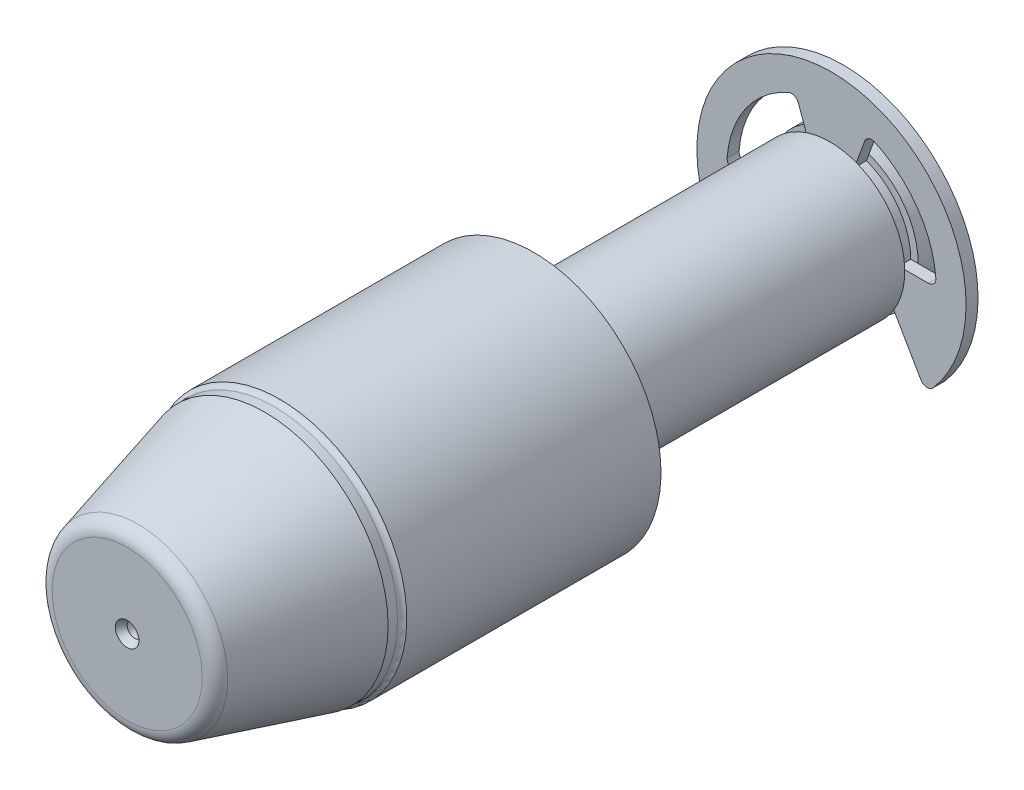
ISO-10303-21;
HEADER;
FILE_DESCRIPTION(('STEP AP214'),'2;1');
FILE_NAME('part.step','',(''),(''),'','','');
FILE_SCHEMA(('AUTOMOTIVE_DESIGN { 1 0 10303 214 1 1 1 1 }'));
ENDSEC;
DATA;
#1=APPLICATION_CONTEXT('core data for automotive mechanical design processes');
#2=APPLICATION_PROTOCOL_DEFINITION('international standard','automotive_design',2000,#1);
#3=PRODUCT_CONTEXT('',#1,'mechanical');
#4=PRODUCT('Part','Part','',(#3));
#5=PRODUCT_RELATED_PRODUCT_CATEGORY('part','',(#4));
#6=PRODUCT_DEFINITION_FORMATION('','',#4);
#7=PRODUCT_DEFINITION_CONTEXT('part definition',#1,'design');
#8=PRODUCT_DEFINITION('design','',#6,#7);
#9=PRODUCT_DEFINITION_SHAPE('','',#8);
#10=(LENGTH_UNIT() NAMED_UNIT(*) SI_UNIT(.MILLI.,.METRE.));
#11=(NAMED_UNIT(*) PLANE_ANGLE_UNIT() SI_UNIT($,.RADIAN.));
#12=(NAMED_UNIT(*) SI_UNIT($,.STERADIAN.) SOLID_ANGLE_UNIT());
#13=UNCERTAINTY_MEASURE_WITH_UNIT(LENGTH_MEASURE(1.E-05),#10,'distance_accuracy_value','');
#14=(GEOMETRIC_REPRESENTATION_CONTEXT(3) GLOBAL_UNCERTAINTY_ASSIGNED_CONTEXT((#13)) GLOBAL_UNIT_ASSIGNED_CONTEXT((#10,
#11,#12)) REPRESENTATION_CONTEXT('',''));
#15=CARTESIAN_POINT('',(0.,0.,0.));
#16=DIRECTION('',(0.,0.,1.));
#17=DIRECTION('',(1.,0.,0.));
#18=AXIS2_PLACEMENT_3D('',#15,#16,#17);
#19=CARTESIAN_POINT('',(0.,0.,26.2));
#20=DIRECTION('',(0.,0.,-1.));
#21=DIRECTION('',(0.,-1.,0.));
#22=AXIS2_PLACEMENT_3D('',#19,#20,#21);
#23=TOROIDAL_SURFACE('',#22,5.01754044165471,1.);
#24=CARTESIAN_POINT('',(0.,0.,26.4588190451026));
#25=DIRECTION('',(0.,0.,-1.));
#26=DIRECTION('',(0.,-1.,0.));
#27=AXIS2_PLACEMENT_3D('',#24,#25,#26);
#28=CIRCLE('',#27,5.98346626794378);
#29=CARTESIAN_POINT('',(0.,-5.98346626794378,26.4588190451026));
#30=VERTEX_POINT('',#29);
#31=EDGE_CURVE('E186',#30,#30,#28,.T.);
#32=ORIENTED_EDGE('',*,*,#31,.F.);
#33=EDGE_LOOP('',(#32));
#34=FACE_BOUND('',#33,.T.);
#35=CARTESIAN_POINT('',(0.,0.,27.2));
#36=DIRECTION('',(0.,0.,-1.));
#37=DIRECTION('',(0.,-1.,0.));
#38=AXIS2_PLACEMENT_3D('',#35,#36,#37);
#39=CIRCLE('',#38,5.01754044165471);
#40=CARTESIAN_POINT('',(0.,-5.01754044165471,27.2));
#41=VERTEX_POINT('',#40);
#42=EDGE_CURVE('E190',#41,#41,#39,.T.);
#43=ORIENTED_EDGE('',*,*,#42,.T.);
#44=EDGE_LOOP('',(#43));
#45=FACE_BOUND('',#44,.T.);
#46=ADVANCED_FACE('F14',(#34,#45),#23,.T.);
#47=CARTESIAN_POINT('',(0.,5.01754044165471,27.2));
#48=DIRECTION('',(0.,0.,-1.));
#49=DIRECTION('',(0.,-1.,0.));
#50=AXIS2_PLACEMENT_3D('',#47,#48,#49);
#51=PLANE('',#50);
#52=CARTESIAN_POINT('',(0.,0.,27.2));
#53=DIRECTION('',(0.,0.,-1.));
#54=DIRECTION('',(0.,-1.,0.));
#55=AXIS2_PLACEMENT_3D('',#52,#53,#54);
#56=CIRCLE('',#55,0.788675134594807);
#57=CARTESIAN_POINT('',(0.,-0.788675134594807,27.2));
#58=VERTEX_POINT('',#57);
#59=EDGE_CURVE('E201',#58,#58,#56,.T.);
#60=ORIENTED_EDGE('',*,*,#59,.T.);
#61=EDGE_LOOP('',(#60));
#62=FACE_BOUND('',#61,.T.);
#63=ORIENTED_EDGE('',*,*,#42,.F.);
#64=EDGE_LOOP('',(#63));
#65=FACE_BOUND('',#64,.T.);
#66=ADVANCED_FACE('F406',(#62,#65),#51,.F.);
#67=CARTESIAN_POINT('',(0.,0.,26.4588190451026));
#68=DIRECTION('',(0.,0.,-1.));
#69=DIRECTION('',(0.,-1.,0.));
#70=AXIS2_PLACEMENT_3D('',#67,#68,#69);
#71=CONICAL_SURFACE('',#70,5.98346626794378,0.26179938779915);
#72=CARTESIAN_POINT('',(0.,0.,18.));
#73=DIRECTION('',(0.,0.,-1.));
#74=DIRECTION('',(0.,-1.,0.));
#75=AXIS2_PLACEMENT_3D('',#72,#73,#74);
#76=CIRCLE('',#75,8.25);
#77=CARTESIAN_POINT('',(0.,-8.25,18.));
#78=VERTEX_POINT('',#77);
#79=EDGE_CURVE('E396',#78,#78,#76,.T.);
#80=ORIENTED_EDGE('',*,*,#79,.F.);
#81=EDGE_LOOP('',(#80));
#82=FACE_BOUND('',#81,.T.);
#83=ORIENTED_EDGE('',*,*,#31,.T.);
#84=EDGE_LOOP('',(#83));
#85=FACE_BOUND('',#84,.T.);
#86=ADVANCED_FACE('F402',(#82,#85),#71,.T.);
#87=CARTESIAN_POINT('',(0.,0.,26.7));
#88=DIRECTION('',(0.,0.,1.));
#89=DIRECTION('',(0.,1.,0.));
#90=AXIS2_PLACEMENT_3D('',#87,#88,#89);
#91=CONICAL_SURFACE('',#90,0.5,0.523598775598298);
#92=ORIENTED_EDGE('',*,*,#59,.F.);
#93=EDGE_LOOP('',(#92));
#94=FACE_BOUND('',#93,.T.);
#95=CARTESIAN_POINT('',(0.,0.,26.7));
#96=DIRECTION('',(0.,0.,-1.));
#97=DIRECTION('',(0.,-1.,0.));
#98=AXIS2_PLACEMENT_3D('',#95,#96,#97);
#99=CIRCLE('',#98,0.5);
#100=CARTESIAN_POINT('',(0.,-0.5,26.7));
#101=VERTEX_POINT('',#100);
#102=EDGE_CURVE('E198',#101,#101,#99,.F.);
#103=ORIENTED_EDGE('',*,*,#102,.F.);
#104=EDGE_LOOP('',(#103));
#105=FACE_BOUND('',#104,.T.);
#106=ADVANCED_FACE('F419',(#94,#105),#91,.F.);
#107=CARTESIAN_POINT('',(0.,0.,-23.6077483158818));
#108=DIRECTION('',(0.,0.,-1.));
#109=DIRECTION('',(0.,-1.,0.));
#110=AXIS2_PLACEMENT_3D('',#107,#108,#109);
#111=CYLINDRICAL_SURFACE('',#110,8.25);
#112=CARTESIAN_POINT('',(0.,0.,17.3708099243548));
#113=DIRECTION('',(0.,0.,-1.));
#114=DIRECTION('',(0.,-1.,0.));
#115=AXIS2_PLACEMENT_3D('',#112,#113,#114);
#116=CIRCLE('',#115,8.25);
#117=CARTESIAN_POINT('',(0.,-8.25,17.3708099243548));
#118=VERTEX_POINT('',#117);
#119=EDGE_CURVE('E210',#118,#118,#116,.F.);
#120=ORIENTED_EDGE('',*,*,#119,.T.);
#121=EDGE_LOOP('',(#120));
#122=FACE_BOUND('',#121,.T.);
#123=ORIENTED_EDGE('',*,*,#79,.T.);
#124=EDGE_LOOP('',(#123));
#125=FACE_BOUND('',#124,.T.);
#126=ADVANCED_FACE('F580',(#122,#125),#111,.T.);
#127=CARTESIAN_POINT('',(0.,0.,17.2));
#128=DIRECTION('',(0.,0.,1.));
#129=DIRECTION('',(0.,1.,0.));
#130=AXIS2_PLACEMENT_3D('',#127,#128,#129);
#131=CYLINDRICAL_SURFACE('',#130,0.5);
#132=ORIENTED_EDGE('',*,*,#102,.T.);
#133=EDGE_LOOP('',(#132));
#134=FACE_BOUND('',#133,.T.);
#135=CARTESIAN_POINT('',(0.,0.,23.5317642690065));
#136=DIRECTION('',(0.,0.,-1.));
#137=DIRECTION('',(0.,-1.,0.));
#138=AXIS2_PLACEMENT_3D('',#135,#136,#137);
#139=CIRCLE('',#138,0.5);
#140=CARTESIAN_POINT('',(0.,-0.50000000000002,23.5317642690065));
#141=VERTEX_POINT('',#140);
#142=EDGE_CURVE('E175',#141,#141,#139,.F.);
#143=ORIENTED_EDGE('',*,*,#142,.F.);
#144=EDGE_LOOP('',(#143));
#145=FACE_BOUND('',#144,.T.);
#146=ADVANCED_FACE('F576',(#134,#145),#131,.F.);
#147=CARTESIAN_POINT('',(0.,0.,17.3708099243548));
#148=DIRECTION('',(0.,0.,-1.));
#149=DIRECTION('',(0.,-1.,0.));
#150=AXIS2_PLACEMENT_3D('',#147,#148,#149);
#151=TOROIDAL_SURFACE('',#150,8.65,0.4);
#152=ORIENTED_EDGE('',*,*,#119,.F.);
#153=EDGE_LOOP('',(#152));
#154=FACE_BOUND('',#153,.T.);
#155=CARTESIAN_POINT('',(0.,0.,17.));
#156=DIRECTION('',(0.,0.,-1.));
#157=DIRECTION('',(0.,-1.,0.));
#158=AXIS2_PLACEMENT_3D('',#155,#156,#157);
#159=CIRCLE('',#158,8.5);
#160=CARTESIAN_POINT('',(0.,-8.5,17.));
#161=VERTEX_POINT('',#160);
#162=EDGE_CURVE('E393',#161,#161,#159,.T.);
#163=ORIENTED_EDGE('',*,*,#162,.F.);
#164=EDGE_LOOP('',(#163));
#165=FACE_BOUND('',#164,.T.);
#166=ADVANCED_FACE('F567',(#154,#165),#151,.F.);
#167=CARTESIAN_POINT('',(0.,0.,22.3));
#168=DIRECTION('',(0.,0.,-1.));
#169=DIRECTION('',(0.,-1.,0.));
#170=AXIS2_PLACEMENT_3D('',#167,#168,#169);
#171=CONICAL_SURFACE('',#170,2.55,1.02974425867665);
#172=CARTESIAN_POINT('',(0.,0.,22.3));
#173=DIRECTION('',(0.,0.,-1.));
#174=DIRECTION('',(0.,-1.,0.));
#175=AXIS2_PLACEMENT_3D('',#172,#173,#174);
#176=CIRCLE('',#175,2.55);
#177=CARTESIAN_POINT('',(0.,-2.55,22.3));
#178=VERTEX_POINT('',#177);
#179=EDGE_CURVE('E181',#178,#178,#176,.T.);
#180=CARTESIAN_POINT('',(0.,-0.50000000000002,23.5317642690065));
#181=CARTESIAN_POINT('',(0.,-0.521354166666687,23.5189333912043));
#182=CARTESIAN_POINT('',(0.,-0.542708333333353,23.5061025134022));
#183=CARTESIAN_POINT('',(0.,-0.585416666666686,23.4804407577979));
#184=CARTESIAN_POINT('',(0.,-0.606770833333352,23.4676098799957));
#185=CARTESIAN_POINT('',(0.,-0.649479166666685,23.4419481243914));
#186=CARTESIAN_POINT('',(0.,-0.670833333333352,23.4291172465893));
#187=CARTESIAN_POINT('',(0.,-0.713541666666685,23.403455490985));
#188=CARTESIAN_POINT('',(0.,-0.734895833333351,23.3906246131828));
#189=CARTESIAN_POINT('',(0.,-0.777604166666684,23.3649628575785));
#190=CARTESIAN_POINT('',(0.,-0.79895833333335,23.3521319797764));
#191=CARTESIAN_POINT('',(0.,-0.841666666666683,23.3264702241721));
#192=CARTESIAN_POINT('',(0.,-0.86302083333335,23.3136393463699));
#193=CARTESIAN_POINT('',(0.,-0.905729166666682,23.2879775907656));
#194=CARTESIAN_POINT('',(0.,-0.927083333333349,23.2751467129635));
#195=CARTESIAN_POINT('',(0.,-0.969791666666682,23.2494849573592));
#196=CARTESIAN_POINT('',(0.,-0.991145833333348,23.236654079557));
#197=CARTESIAN_POINT('',(0.,-1.03385416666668,23.2109923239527));
#198=CARTESIAN_POINT('',(0.,-1.05520833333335,23.1981614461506));
#199=CARTESIAN_POINT('',(0.,-1.09791666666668,23.1724996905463));
#200=CARTESIAN_POINT('',(0.,-1.11927083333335,23.1596688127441));
#201=CARTESIAN_POINT('',(0.,-1.16197916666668,23.1340070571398));
#202=CARTESIAN_POINT('',(0.,-1.18333333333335,23.1211761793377));
#203=CARTESIAN_POINT('',(0.,-1.22604166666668,23.0955144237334));
#204=CARTESIAN_POINT('',(0.,-1.24739583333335,23.0826835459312));
#205=CARTESIAN_POINT('',(0.,-1.29010416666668,23.0570217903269));
#206=CARTESIAN_POINT('',(0.,-1.31145833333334,23.0441909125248));
#207=CARTESIAN_POINT('',(0.,-1.35416666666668,23.0185291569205));
#208=CARTESIAN_POINT('',(0.,-1.37552083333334,23.0056982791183));
#209=CARTESIAN_POINT('',(0.,-1.41822916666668,22.980036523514));
#210=CARTESIAN_POINT('',(0.,-1.43958333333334,22.9672056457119));
#211=CARTESIAN_POINT('',(0.,-1.48229166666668,22.9415438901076));
#212=CARTESIAN_POINT('',(0.,-1.50364583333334,22.9287130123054));
#213=CARTESIAN_POINT('',(0.,-1.54635416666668,22.9030512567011));
#214=CARTESIAN_POINT('',(0.,-1.56770833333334,22.8902203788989));
#215=CARTESIAN_POINT('',(0.,-1.61041666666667,22.8645586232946));
#216=CARTESIAN_POINT('',(0.,-1.63177083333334,22.8517277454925));
#217=CARTESIAN_POINT('',(0.,-1.67447916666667,22.8260659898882));
#218=CARTESIAN_POINT('',(0.,-1.69583333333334,22.813235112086));
#219=CARTESIAN_POINT('',(0.,-1.73854166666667,22.7875733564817));
#220=CARTESIAN_POINT('',(0.,-1.75989583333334,22.7747424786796));
#221=CARTESIAN_POINT('',(0.,-1.80260416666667,22.7490807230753));
#222=CARTESIAN_POINT('',(0.,-1.82395833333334,22.7362498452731));
#223=CARTESIAN_POINT('',(0.,-1.86666666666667,22.7105880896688));
#224=CARTESIAN_POINT('',(0.,-1.88802083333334,22.6977572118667));
#225=CARTESIAN_POINT('',(0.,-1.93072916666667,22.6720954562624));
#226=CARTESIAN_POINT('',(0.,-1.95208333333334,22.6592645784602));
#227=CARTESIAN_POINT('',(0.,-1.99479166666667,22.6336028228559));
#228=CARTESIAN_POINT('',(0.,-2.01614583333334,22.6207719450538));
#229=CARTESIAN_POINT('',(0.,-2.05885416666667,22.5951101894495));
#230=CARTESIAN_POINT('',(0.,-2.08020833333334,22.5822793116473));
#231=CARTESIAN_POINT('',(0.,-2.12291666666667,22.556617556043));
#232=CARTESIAN_POINT('',(0.,-2.14427083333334,22.5437866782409));
#233=CARTESIAN_POINT('',(0.,-2.18697916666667,22.5181249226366));
#234=CARTESIAN_POINT('',(0.,-2.20833333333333,22.5052940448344));
#235=CARTESIAN_POINT('',(0.,-2.25104166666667,22.4796322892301));
#236=CARTESIAN_POINT('',(0.,-2.27239583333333,22.466801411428));
#237=CARTESIAN_POINT('',(0.,-2.31510416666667,22.4411396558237));
#238=CARTESIAN_POINT('',(0.,-2.33645833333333,22.4283087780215));
#239=CARTESIAN_POINT('',(0.,-2.37916666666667,22.4026470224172));
#240=CARTESIAN_POINT('',(0.,-2.40052083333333,22.3898161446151));
#241=CARTESIAN_POINT('',(0.,-2.44322916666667,22.3641543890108));
#242=CARTESIAN_POINT('',(0.,-2.46458333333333,22.3513235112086));
#243=CARTESIAN_POINT('',(0.,-2.50729166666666,22.3256617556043));
#244=CARTESIAN_POINT('',(0.,-2.52864583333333,22.3128308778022));
#245=CARTESIAN_POINT('',(0.,-2.55,22.3));
#246=B_SPLINE_CURVE_WITH_KNOTS('',3,(#180,#181,#182,#183,#184,#185,#186,#187,#188,#189,#190,
#191,#192,#193,#194,#195,#196,#197,#198,#199,#200,#201,#202,#203,#204,#205,#206,#207,#208,#209,
#210,#211,#212,#213,#214,#215,#216,#217,#218,#219,#220,#221,#222,#223,#224,#225,#226,#227,#228,
#229,#230,#231,#232,#233,#234,#235,#236,#237,#238,#239,#240,#241,#242,#243,#244,#245),
.UNSPECIFIED.,.F.,.F.,(4,2,2,2,2,2,2,2,2,2,2,2,2,2,2,2,2,2,2,2,2,2,2,2,2,2,2,2,2,2,2,2,4),(0.,
0.0747374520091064,0.149474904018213,0.22421235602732,0.298949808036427,0.373687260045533,
0.44842471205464,0.523162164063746,0.597899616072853,0.67263706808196,0.747374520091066,
0.822111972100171,0.896849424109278,0.971586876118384,1.04632432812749,1.1210617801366,
1.1957992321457,1.27053668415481,1.34527413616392,1.42001158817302,1.49474904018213,
1.56948649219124,1.64422394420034,1.71896139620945,1.79369884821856,1.86843630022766,
1.94317375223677,2.01791120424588,2.09264865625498,2.16738610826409,2.2421235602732,
2.3168610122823,2.39159846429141),.UNSPECIFIED.);
#247=EDGE_CURVE('BSEAM565',#141,#178,#246,.T.);
#248=ORIENTED_EDGE('',*,*,#142,.T.);
#249=ORIENTED_EDGE('',*,*,#179,.T.);
#250=ORIENTED_EDGE('',*,*,#247,.T.);
#251=ORIENTED_EDGE('',*,*,#247,.F.);
#252=EDGE_LOOP('',(#248,#250,#249,#251));
#253=FACE_BOUND('',#252,.T.);
#254=ADVANCED_FACE('F565',(#253),#171,.F.);
#255=CARTESIAN_POINT('',(0.,0.,-23.6077483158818));
#256=DIRECTION('',(0.,0.,-1.));
#257=DIRECTION('',(0.,-1.,0.));
#258=AXIS2_PLACEMENT_3D('',#255,#256,#257);
#259=CYLINDRICAL_SURFACE('',#258,8.5);
#260=CARTESIAN_POINT('',(0.,0.,0.));
#261=DIRECTION('',(0.,0.,-1.));
#262=DIRECTION('',(0.,-1.,0.));
#263=AXIS2_PLACEMENT_3D('',#260,#261,#262);
#264=CIRCLE('',#263,8.5);
#265=CARTESIAN_POINT('',(0.,-8.5,0.));
#266=VERTEX_POINT('',#265);
#267=EDGE_CURVE('E390',#266,#266,#264,.T.);
#268=ORIENTED_EDGE('',*,*,#267,.F.);
#269=EDGE_LOOP('',(#268));
#270=FACE_BOUND('',#269,.T.);
#271=ORIENTED_EDGE('',*,*,#162,.T.);
#272=EDGE_LOOP('',(#271));
#273=FACE_BOUND('',#272,.T.);
#274=ADVANCED_FACE('F561',(#270,#273),#259,.T.);
#275=CARTESIAN_POINT('',(0.,0.,-22.7));
#276=DIRECTION('',(0.,0.,-1.));
#277=DIRECTION('',(0.,-1.,0.));
#278=AXIS2_PLACEMENT_3D('',#275,#276,#277);
#279=CYLINDRICAL_SURFACE('',#278,2.55);
#280=CARTESIAN_POINT('',(0.,0.,-22.2));
#281=DIRECTION('',(0.,0.,1.));
#282=DIRECTION('',(0.,1.,0.));
#283=AXIS2_PLACEMENT_3D('',#280,#281,#282);
#284=CIRCLE('',#283,2.55);
#285=CARTESIAN_POINT('',(0.,2.55,-22.2));
#286=VERTEX_POINT('',#285);
#287=EDGE_CURVE('E192',#286,#286,#284,.F.);
#288=ORIENTED_EDGE('',*,*,#287,.T.);
#289=EDGE_LOOP('',(#288));
#290=FACE_BOUND('',#289,.T.);
#291=ORIENTED_EDGE('',*,*,#179,.F.);
#292=EDGE_LOOP('',(#291));
#293=FACE_BOUND('',#292,.T.);
#294=ADVANCED_FACE('F558',(#290,#293),#279,.F.);
#295=CARTESIAN_POINT('',(0.,5.,0.));
#296=DIRECTION('',(0.,0.,1.));
#297=DIRECTION('',(0.,1.,0.));
#298=AXIS2_PLACEMENT_3D('',#295,#296,#297);
#299=PLANE('',#298);
#300=CARTESIAN_POINT('',(0.,0.,0.));
#301=DIRECTION('',(0.,0.,1.));
#302=DIRECTION('',(0.,1.,0.));
#303=AXIS2_PLACEMENT_3D('',#300,#301,#302);
#304=CIRCLE('',#303,5.4);
#305=CARTESIAN_POINT('',(0.,5.4,0.));
#306=VERTEX_POINT('',#305);
#307=EDGE_CURVE('E207',#306,#306,#304,.T.);
#308=ORIENTED_EDGE('',*,*,#307,.T.);
#309=EDGE_LOOP('',(#308));
#310=FACE_BOUND('',#309,.T.);
#311=ORIENTED_EDGE('',*,*,#267,.T.);
#312=EDGE_LOOP('',(#311));
#313=FACE_BOUND('',#312,.T.);
#314=ADVANCED_FACE('F554',(#310,#313),#299,.F.);
#315=CARTESIAN_POINT('',(0.,0.,-22.2));
#316=DIRECTION('',(0.,0.,-1.));
#317=DIRECTION('',(0.,-1.,0.));
#318=AXIS2_PLACEMENT_3D('',#315,#316,#317);
#319=CONICAL_SURFACE('',#318,2.55,0.523598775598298);
#320=CARTESIAN_POINT('',(0.,0.,-22.7));
#321=DIRECTION('',(0.,0.,1.));
#322=DIRECTION('',(0.,1.,0.));
#323=AXIS2_PLACEMENT_3D('',#320,#321,#322);
#324=CIRCLE('',#323,2.8386751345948);
#325=CARTESIAN_POINT('',(0.,2.8386751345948,-22.7));
#326=VERTEX_POINT('',#325);
#327=EDGE_CURVE('E195',#326,#326,#324,.T.);
#328=ORIENTED_EDGE('',*,*,#327,.F.);
#329=EDGE_LOOP('',(#328));
#330=FACE_BOUND('',#329,.T.);
#331=ORIENTED_EDGE('',*,*,#287,.F.);
#332=EDGE_LOOP('',(#331));
#333=FACE_BOUND('',#332,.T.);
#334=ADVANCED_FACE('F545',(#330,#333),#319,.F.);
#335=CARTESIAN_POINT('',(0.,0.,-0.4));
#336=DIRECTION('',(0.,0.,1.));
#337=DIRECTION('',(0.,1.,0.));
#338=AXIS2_PLACEMENT_3D('',#335,#336,#337);
#339=TOROIDAL_SURFACE('',#338,5.4,0.4);
#340=ORIENTED_EDGE('',*,*,#307,.F.);
#341=EDGE_LOOP('',(#340));
#342=FACE_BOUND('',#341,.T.);
#343=CARTESIAN_POINT('',(0.,0.,-0.4));
#344=DIRECTION('',(0.,0.,1.));
#345=DIRECTION('',(0.,1.,0.));
#346=AXIS2_PLACEMENT_3D('',#343,#344,#345);
#347=CIRCLE('',#346,5.);
#348=CARTESIAN_POINT('',(0.,5.,-0.4));
#349=VERTEX_POINT('',#348);
#350=EDGE_CURVE('E204',#349,#349,#347,.F.);
#351=ORIENTED_EDGE('',*,*,#350,.F.);
#352=EDGE_LOOP('',(#351));
#353=FACE_BOUND('',#352,.T.);
#354=ADVANCED_FACE('F536',(#342,#353),#339,.F.);
#355=CARTESIAN_POINT('',(0.,0.,-22.7));
#356=DIRECTION('',(0.,0.,1.));
#357=DIRECTION('',(0.,1.,0.));
#358=AXIS2_PLACEMENT_3D('',#355,#356,#357);
#359=PLANE('',#358);
#360=CARTESIAN_POINT('',(0.,0.,-22.7));
#361=DIRECTION('',(0.,0.,1.));
#362=DIRECTION('',(0.,1.,0.));
#363=AXIS2_PLACEMENT_3D('',#360,#361,#362);
#364=CIRCLE('',#363,4.5);
#365=CARTESIAN_POINT('',(0.,4.5,-22.7));
#366=VERTEX_POINT('',#365);
#367=EDGE_CURVE('E213',#366,#366,#364,.F.);
#368=ORIENTED_EDGE('',*,*,#367,.T.);
#369=EDGE_LOOP('',(#368));
#370=FACE_BOUND('',#369,.T.);
#371=ORIENTED_EDGE('',*,*,#327,.T.);
#372=EDGE_LOOP('',(#371));
#373=FACE_BOUND('',#372,.T.);
#374=ADVANCED_FACE('F534',(#370,#373),#359,.F.);
#375=CARTESIAN_POINT('',(0.,0.,-23.6077483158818));
#376=DIRECTION('',(0.,0.,-1.));
#377=DIRECTION('',(0.,-1.,0.));
#378=AXIS2_PLACEMENT_3D('',#375,#376,#377);
#379=CYLINDRICAL_SURFACE('',#378,5.);
#380=ORIENTED_EDGE('',*,*,#350,.T.);
#381=EDGE_LOOP('',(#380));
#382=FACE_BOUND('',#381,.T.);
#383=CARTESIAN_POINT('',(0.,0.,-19.8));
#384=DIRECTION('',(0.,0.,-1.));
#385=DIRECTION('',(0.,-1.,0.));
#386=AXIS2_PLACEMENT_3D('',#383,#384,#385);
#387=CIRCLE('',#386,5.);
#388=CARTESIAN_POINT('',(0.,-5.,-19.8));
#389=VERTEX_POINT('',#388);
#390=EDGE_CURVE('E387',#389,#389,#387,.T.);
#391=ORIENTED_EDGE('',*,*,#390,.F.);
#392=EDGE_LOOP('',(#391));
#393=FACE_BOUND('',#392,.T.);
#394=ADVANCED_FACE('F532',(#382,#393),#379,.T.);
#395=CARTESIAN_POINT('',(0.,0.,-22.7));
#396=DIRECTION('',(0.,0.,1.));
#397=DIRECTION('',(0.,1.,0.));
#398=AXIS2_PLACEMENT_3D('',#395,#396,#397);
#399=CONICAL_SURFACE('',#398,4.5,0.785398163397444);
#400=CARTESIAN_POINT('',(0.,0.,-22.2));
#401=DIRECTION('',(0.,0.,1.));
#402=DIRECTION('',(0.,1.,0.));
#403=AXIS2_PLACEMENT_3D('',#400,#401,#402);
#404=CIRCLE('',#403,5.);
#405=CARTESIAN_POINT('',(0.,5.,-22.2));
#406=VERTEX_POINT('',#405);
#407=EDGE_CURVE('E216',#406,#406,#404,.T.);
#408=ORIENTED_EDGE('',*,*,#407,.F.);
#409=EDGE_LOOP('',(#408));
#410=FACE_BOUND('',#409,.T.);
#411=ORIENTED_EDGE('',*,*,#367,.F.);
#412=EDGE_LOOP('',(#411));
#413=FACE_BOUND('',#412,.T.);
#414=ADVANCED_FACE('F438',(#410,#413),#399,.T.);
#415=CARTESIAN_POINT('',(0.,0.,-23.6077483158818));
#416=DIRECTION('',(0.,0.,-1.));
#417=DIRECTION('',(0.,-1.,0.));
#418=AXIS2_PLACEMENT_3D('',#415,#416,#417);
#419=CYLINDRICAL_SURFACE('',#418,5.);
#420=ORIENTED_EDGE('',*,*,#407,.T.);
#421=EDGE_LOOP('',(#420));
#422=FACE_BOUND('',#421,.T.);
#423=CARTESIAN_POINT('',(0.,0.,-20.7));
#424=DIRECTION('',(0.,0.,-1.));
#425=DIRECTION('',(0.,-1.,0.));
#426=AXIS2_PLACEMENT_3D('',#423,#424,#425);
#427=CIRCLE('',#426,5.);
#428=CARTESIAN_POINT('',(-4.18419829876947,-2.73724032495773,-20.7));
#429=VERTEX_POINT('',#428);
#430=CARTESIAN_POINT('',(-5.,0.,-20.7));
#431=VERTEX_POINT('',#430);
#432=EDGE_CURVE('E321',#429,#431,#427,.T.);
#433=ORIENTED_EDGE('',*,*,#432,.T.);
#434=CARTESIAN_POINT('',(-1.71010071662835,4.69846310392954,-20.7));
#435=VERTEX_POINT('',#434);
#436=EDGE_CURVE('E362',#431,#435,#427,.T.);
#437=ORIENTED_EDGE('',*,*,#436,.T.);
#438=CARTESIAN_POINT('',(1.71010071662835,4.69846310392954,-20.7));
#439=VERTEX_POINT('',#438);
#440=EDGE_CURVE('E357',#435,#439,#427,.T.);
#441=ORIENTED_EDGE('',*,*,#440,.T.);
#442=CARTESIAN_POINT('',(5.,0.,-20.7));
#443=VERTEX_POINT('',#442);
#444=EDGE_CURVE('E360',#439,#443,#427,.T.);
#445=ORIENTED_EDGE('',*,*,#444,.T.);
#446=CARTESIAN_POINT('',(4.18419829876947,-2.73724032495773,-20.7));
#447=VERTEX_POINT('',#446);
#448=EDGE_CURVE('E376',#443,#447,#427,.T.);
#449=ORIENTED_EDGE('',*,*,#448,.T.);
#450=EDGE_CURVE('E377',#447,#429,#427,.T.);
#451=ORIENTED_EDGE('',*,*,#450,.T.);
#452=EDGE_LOOP('',(#433,#437,#441,#445,#449,#451));
#453=FACE_BOUND('',#452,.T.);
#454=ADVANCED_FACE('F358',(#422,#453),#419,.T.);
#455=CARTESIAN_POINT('',(0.,4.5,-20.7));
#456=DIRECTION('',(0.,0.,-1.));
#457=DIRECTION('',(0.,-1.,0.));
#458=AXIS2_PLACEMENT_3D('',#455,#456,#457);
#459=PLANE('',#458);
#460=DIRECTION('',(-1.,0.,0.));
#461=VECTOR('',#460,1.);
#462=CARTESIAN_POINT('',(0.,0.,-20.7));
#463=LINE('',#462,#461);
#464=CARTESIAN_POINT('',(4.5,0.,-20.7));
#465=VERTEX_POINT('',#464);
#466=EDGE_CURVE('E9',#443,#465,#463,.T.);
#467=ORIENTED_EDGE('',*,*,#466,.F.);
#468=ORIENTED_EDGE('',*,*,#444,.F.);
#469=DIRECTION('',(0.342020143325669,0.939692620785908,0.));
#470=VECTOR('',#469,1.);
#471=CARTESIAN_POINT('',(1.44627212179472,3.9735999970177,-20.7));
#472=LINE('',#471,#470);
#473=CARTESIAN_POINT('',(1.53909064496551,4.22861679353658,-20.7));
#474=VERTEX_POINT('',#473);
#475=EDGE_CURVE('E24',#474,#439,#472,.T.);
#476=ORIENTED_EDGE('',*,*,#475,.F.);
#477=CARTESIAN_POINT('',(0.,0.,-20.7));
#478=DIRECTION('',(0.,0.,-1.));
#479=DIRECTION('',(0.,-1.,0.));
#480=AXIS2_PLACEMENT_3D('',#477,#478,#479);
#481=CIRCLE('',#480,4.5);
#482=EDGE_CURVE('E382',#474,#465,#481,.T.);
#483=ORIENTED_EDGE('',*,*,#482,.T.);
#484=EDGE_LOOP('',(#467,#468,#476,#483));
#485=FACE_BOUND('',#484,.T.);
#486=ADVANCED_FACE('F374',(#485),#459,.F.);
#487=DIRECTION('',(0.5,0.866025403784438,0.));
#488=VECTOR('',#487,1.);
#489=CARTESIAN_POINT('',(-0.00433173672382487,4.50250092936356,-20.7));
#490=LINE('',#489,#488);
#491=CARTESIAN_POINT('',(-3.9,-2.24499443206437,-20.7));
#492=VERTEX_POINT('',#491);
#493=EDGE_CURVE('E241',#429,#492,#490,.T.);
#494=ORIENTED_EDGE('',*,*,#493,.F.);
#495=ORIENTED_EDGE('',*,*,#450,.F.);
#496=DIRECTION('',(0.5,-0.866025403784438,0.));
#497=VECTOR('',#496,1.);
#498=CARTESIAN_POINT('',(0.00433173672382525,4.50250092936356,-20.7));
#499=LINE('',#498,#497);
#500=CARTESIAN_POINT('',(3.9,-2.24499443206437,-20.7));
#501=VERTEX_POINT('',#500);
#502=EDGE_CURVE('E33',#501,#447,#499,.T.);
#503=ORIENTED_EDGE('',*,*,#502,.F.);
#504=EDGE_CURVE('E379',#501,#492,#481,.T.);
#505=ORIENTED_EDGE('',*,*,#504,.T.);
#506=EDGE_LOOP('',(#494,#495,#503,#505));
#507=FACE_BOUND('',#506,.T.);
#508=ADVANCED_FACE('F502',(#507),#459,.F.);
#509=DIRECTION('',(0.342020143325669,-0.939692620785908,0.));
#510=VECTOR('',#509,1.);
#511=CARTESIAN_POINT('',(-1.44627212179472,3.9735999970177,-20.7));
#512=LINE('',#511,#510);
#513=CARTESIAN_POINT('',(-1.53909064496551,4.22861679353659,-20.7));
#514=VERTEX_POINT('',#513);
#515=EDGE_CURVE('E247',#435,#514,#512,.T.);
#516=ORIENTED_EDGE('',*,*,#515,.F.);
#517=ORIENTED_EDGE('',*,*,#436,.F.);
#518=DIRECTION('',(-1.,0.,0.));
#519=VECTOR('',#518,1.);
#520=CARTESIAN_POINT('',(0.,0.,-20.7));
#521=LINE('',#520,#519);
#522=CARTESIAN_POINT('',(-4.5,0.,-20.7));
#523=VERTEX_POINT('',#522);
#524=EDGE_CURVE('E244',#523,#431,#521,.T.);
#525=ORIENTED_EDGE('',*,*,#524,.F.);
#526=EDGE_CURVE('E384',#523,#514,#481,.T.);
#527=ORIENTED_EDGE('',*,*,#526,.T.);
#528=EDGE_LOOP('',(#516,#517,#525,#527));
#529=FACE_BOUND('',#528,.T.);
#530=ADVANCED_FACE('F511',(#529),#459,.F.);
#531=CARTESIAN_POINT('',(0.,4.5,-19.8));
#532=DIRECTION('',(0.,0.,1.));
#533=DIRECTION('',(0.,1.,0.));
#534=AXIS2_PLACEMENT_3D('',#531,#532,#533);
#535=PLANE('',#534);
#536=CARTESIAN_POINT('',(0.,0.,-19.8));
#537=DIRECTION('',(0.,0.,-1.));
#538=DIRECTION('',(0.,-1.,0.));
#539=AXIS2_PLACEMENT_3D('',#536,#537,#538);
#540=CIRCLE('',#539,4.5);
#541=CARTESIAN_POINT('',(0.,-4.5,-19.8));
#542=VERTEX_POINT('',#541);
#543=EDGE_CURVE('E383',#542,#542,#540,.T.);
#544=ORIENTED_EDGE('',*,*,#543,.F.);
#545=EDGE_LOOP('',(#544));
#546=FACE_BOUND('',#545,.T.);
#547=ORIENTED_EDGE('',*,*,#390,.T.);
#548=EDGE_LOOP('',(#547));
#549=FACE_BOUND('',#548,.T.);
#550=ADVANCED_FACE('F433',(#546,#549),#535,.F.);
#551=CARTESIAN_POINT('',(0.,0.,-23.6077483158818));
#552=DIRECTION('',(0.,0.,-1.));
#553=DIRECTION('',(0.,-1.,0.));
#554=AXIS2_PLACEMENT_3D('',#551,#552,#553);
#555=CYLINDRICAL_SURFACE('',#554,4.5);
#556=ORIENTED_EDGE('',*,*,#543,.T.);
#557=EDGE_LOOP('',(#556));
#558=FACE_BOUND('',#557,.T.);
#559=DIRECTION('',(0.,0.,-1.));
#560=VECTOR('',#559,1.);
#561=CARTESIAN_POINT('',(1.53909064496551,4.22861679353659,-23.6077483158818));
#562=LINE('',#561,#560);
#563=CARTESIAN_POINT('',(1.53909064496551,4.22861679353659,-19.9));
#564=VERTEX_POINT('',#563);
#565=EDGE_CURVE('E237',#564,#474,#562,.T.);
#566=ORIENTED_EDGE('',*,*,#565,.F.);
#567=CARTESIAN_POINT('',(0.,0.,-19.9));
#568=DIRECTION('',(0.,0.,-1.));
#569=DIRECTION('',(-1.,0.,0.));
#570=AXIS2_PLACEMENT_3D('',#567,#568,#569);
#571=CIRCLE('',#570,4.5);
#572=CARTESIAN_POINT('',(-1.53909064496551,4.22861679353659,-19.9));
#573=VERTEX_POINT('',#572);
#574=EDGE_CURVE('E223',#573,#564,#571,.T.);
#575=ORIENTED_EDGE('',*,*,#574,.F.);
#576=DIRECTION('',(0.,0.,-1.));
#577=VECTOR('',#576,1.);
#578=CARTESIAN_POINT('',(-1.53909064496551,4.22861679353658,-23.6077483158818));
#579=LINE('',#578,#577);
#580=EDGE_CURVE('E234',#514,#573,#579,.F.);
#581=ORIENTED_EDGE('',*,*,#580,.F.);
#582=ORIENTED_EDGE('',*,*,#526,.F.);
#583=DIRECTION('',(0.,0.,-1.));
#584=VECTOR('',#583,1.);
#585=CARTESIAN_POINT('',(-4.5,0.,-23.6077483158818));
#586=LINE('',#585,#584);
#587=CARTESIAN_POINT('',(-4.5,0.,-19.9));
#588=VERTEX_POINT('',#587);
#589=EDGE_CURVE('E226',#588,#523,#586,.T.);
#590=ORIENTED_EDGE('',*,*,#589,.F.);
#591=CARTESIAN_POINT('',(-3.9,-2.24499443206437,-19.9));
#592=VERTEX_POINT('',#591);
#593=EDGE_CURVE('E219',#592,#588,#571,.T.);
#594=ORIENTED_EDGE('',*,*,#593,.F.);
#595=DIRECTION('',(0.,0.,-1.));
#596=VECTOR('',#595,1.);
#597=CARTESIAN_POINT('',(-3.9,-2.24499443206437,-23.6077483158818));
#598=LINE('',#597,#596);
#599=EDGE_CURVE('E222',#492,#592,#598,.F.);
#600=ORIENTED_EDGE('',*,*,#599,.F.);
#601=ORIENTED_EDGE('',*,*,#504,.F.);
#602=DIRECTION('',(0.,0.,-1.));
#603=VECTOR('',#602,1.);
#604=CARTESIAN_POINT('',(3.9,-2.24499443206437,-23.6077483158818));
#605=LINE('',#604,#603);
#606=CARTESIAN_POINT('',(3.9,-2.24499443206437,-19.9));
#607=VERTEX_POINT('',#606);
#608=EDGE_CURVE('E229',#607,#501,#605,.T.);
#609=ORIENTED_EDGE('',*,*,#608,.F.);
#610=CARTESIAN_POINT('',(4.5,0.,-19.9));
#611=VERTEX_POINT('',#610);
#612=EDGE_CURVE('E138',#611,#607,#571,.T.);
#613=ORIENTED_EDGE('',*,*,#612,.F.);
#614=DIRECTION('',(0.,0.,-1.));
#615=VECTOR('',#614,1.);
#616=CARTESIAN_POINT('',(4.5,0.,-23.6077483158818));
#617=LINE('',#616,#615);
#618=EDGE_CURVE('E231',#465,#611,#617,.F.);
#619=ORIENTED_EDGE('',*,*,#618,.F.);
#620=ORIENTED_EDGE('',*,*,#482,.F.);
#621=EDGE_LOOP('',(#566,#575,#581,#582,#590,#594,#600,#601,#609,#613,#619,#620));
#622=FACE_BOUND('',#621,.T.);
#623=ADVANCED_FACE('F424',(#558,#622),#555,.T.);
#624=CARTESIAN_POINT('',(0.,0.,-20.7));
#625=DIRECTION('',(0.,0.,-1.));
#626=DIRECTION('',(-1.,0.,0.));
#627=AXIS2_PLACEMENT_3D('',#624,#625,#626);
#628=PLANE('',#627);
#629=ORIENTED_EDGE('',*,*,#440,.F.);
#630=DIRECTION('',(-0.342020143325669,0.939692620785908,0.));
#631=VECTOR('',#630,1.);
#632=CARTESIAN_POINT('',(-2.21654386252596,6.08990421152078,-20.7));
#633=LINE('',#632,#631);
#634=CARTESIAN_POINT('',(-2.21654386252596,6.08990421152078,-20.7));
#635=VERTEX_POINT('',#634);
#636=EDGE_CURVE('E260',#435,#635,#633,.T.);
#637=ORIENTED_EDGE('',*,*,#636,.T.);
#638=CARTESIAN_POINT('',(-2.68639017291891,5.91889413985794,-20.7));
#639=DIRECTION('',(0.,0.,1.));
#640=DIRECTION('',(1.,0.,0.));
#641=AXIS2_PLACEMENT_3D('',#638,#639,#640);
#642=CIRCLE('',#641,0.5);
#643=CARTESIAN_POINT('',(-2.89303557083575,6.37419368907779,-20.7));
#644=VERTEX_POINT('',#643);
#645=EDGE_CURVE('E262',#635,#644,#642,.T.);
#646=ORIENTED_EDGE('',*,*,#645,.T.);
#647=CARTESIAN_POINT('',(0.,0.,-20.7));
#648=DIRECTION('',(0.,0.,1.));
#649=DIRECTION('',(-1.,0.,0.));
#650=AXIS2_PLACEMENT_3D('',#647,#648,#649);
#651=CIRCLE('',#650,7.);
#652=CARTESIAN_POINT('',(-6.97925921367,0.538461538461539,-20.7));
#653=VERTEX_POINT('',#652);
#654=EDGE_CURVE('E264',#644,#653,#651,.T.);
#655=ORIENTED_EDGE('',*,*,#654,.T.);
#656=CARTESIAN_POINT('',(-6.48074069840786,0.5,-20.7));
#657=DIRECTION('',(0.,0.,1.));
#658=DIRECTION('',(-1.,0.,0.));
#659=AXIS2_PLACEMENT_3D('',#656,#657,#658);
#660=CIRCLE('',#659,0.5);
#661=CARTESIAN_POINT('',(-6.48074069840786,0.,-20.7));
#662=VERTEX_POINT('',#661);
#663=EDGE_CURVE('E266',#653,#662,#660,.T.);
#664=ORIENTED_EDGE('',*,*,#663,.T.);
#665=DIRECTION('',(1.,0.,0.));
#666=VECTOR('',#665,1.);
#667=CARTESIAN_POINT('',(-4.5,0.,-20.7));
#668=LINE('',#667,#666);
#669=EDGE_CURVE('E268',#662,#431,#668,.T.);
#670=ORIENTED_EDGE('',*,*,#669,.T.);
#671=ORIENTED_EDGE('',*,*,#432,.F.);
#672=DIRECTION('',(-0.5,-0.866025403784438,0.));
#673=VECTOR('',#672,1.);
#674=CARTESIAN_POINT('',(-3.9,-2.24499443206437,-20.7));
#675=LINE('',#674,#673);
#676=CARTESIAN_POINT('',(-5.97345989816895,-5.83633232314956,-20.7));
#677=VERTEX_POINT('',#676);
#678=EDGE_CURVE('E271',#429,#677,#675,.T.);
#679=ORIENTED_EDGE('',*,*,#678,.T.);
#680=CARTESIAN_POINT('',(-6.40647260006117,-5.58633232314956,-20.7));
#681=DIRECTION('',(0.,0.,-1.));
#682=DIRECTION('',(1.,0.,0.));
#683=AXIS2_PLACEMENT_3D('',#680,#681,#682);
#684=CIRCLE('',#683,0.5);
#685=CARTESIAN_POINT('',(-6.78332392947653,-5.91494010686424,-20.7));
#686=VERTEX_POINT('',#685);
#687=EDGE_CURVE('E273',#677,#686,#684,.T.);
#688=ORIENTED_EDGE('',*,*,#687,.T.);
#689=CARTESIAN_POINT('',(0.,0.,-20.7));
#690=DIRECTION('',(0.,0.,-1.));
#691=DIRECTION('',(-1.,0.,0.));
#692=AXIS2_PLACEMENT_3D('',#689,#690,#691);
#693=CIRCLE('',#692,9.);
#694=CARTESIAN_POINT('',(6.78332392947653,-5.91494010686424,-20.7));
#695=VERTEX_POINT('',#694);
#696=EDGE_CURVE('E275',#686,#695,#693,.T.);
#697=ORIENTED_EDGE('',*,*,#696,.T.);
#698=CARTESIAN_POINT('',(6.40647260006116,-5.58633232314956,-20.7));
#699=DIRECTION('',(0.,0.,-1.));
#700=DIRECTION('',(-1.,0.,0.));
#701=AXIS2_PLACEMENT_3D('',#698,#699,#700);
#702=CIRCLE('',#701,0.5);
#703=CARTESIAN_POINT('',(5.97345989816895,-5.83633232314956,-20.7));
#704=VERTEX_POINT('',#703);
#705=EDGE_CURVE('E277',#695,#704,#702,.T.);
#706=ORIENTED_EDGE('',*,*,#705,.T.);
#707=DIRECTION('',(-0.5,0.866025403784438,0.));
#708=VECTOR('',#707,1.);
#709=CARTESIAN_POINT('',(3.9,-2.24499443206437,-20.7));
#710=LINE('',#709,#708);
#711=EDGE_CURVE('E132',#704,#447,#710,.T.);
#712=ORIENTED_EDGE('',*,*,#711,.T.);
#713=ORIENTED_EDGE('',*,*,#448,.F.);
#714=DIRECTION('',(1.,0.,0.));
#715=VECTOR('',#714,1.);
#716=CARTESIAN_POINT('',(6.48074069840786,0.,-20.7));
#717=LINE('',#716,#715);
#718=CARTESIAN_POINT('',(6.48074069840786,0.,-20.7));
#719=VERTEX_POINT('',#718);
#720=EDGE_CURVE('E139',#443,#719,#717,.T.);
#721=ORIENTED_EDGE('',*,*,#720,.T.);
#722=CARTESIAN_POINT('',(6.48074069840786,0.5,-20.7));
#723=DIRECTION('',(0.,0.,1.));
#724=DIRECTION('',(1.,0.,0.));
#725=AXIS2_PLACEMENT_3D('',#722,#723,#724);
#726=CIRCLE('',#725,0.5);
#727=CARTESIAN_POINT('',(6.97925921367,0.538461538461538,-20.7));
#728=VERTEX_POINT('',#727);
#729=EDGE_CURVE('E141',#719,#728,#726,.T.);
#730=ORIENTED_EDGE('',*,*,#729,.T.);
#731=CARTESIAN_POINT('',(0.,0.,-20.7));
#732=DIRECTION('',(0.,0.,1.));
#733=DIRECTION('',(-1.,0.,0.));
#734=AXIS2_PLACEMENT_3D('',#731,#732,#733);
#735=CIRCLE('',#734,7.);
#736=CARTESIAN_POINT('',(2.89303557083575,6.37419368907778,-20.7));
#737=VERTEX_POINT('',#736);
#738=EDGE_CURVE('E253',#728,#737,#735,.T.);
#739=ORIENTED_EDGE('',*,*,#738,.T.);
#740=CARTESIAN_POINT('',(2.68639017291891,5.91889413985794,-20.7));
#741=DIRECTION('',(0.,0.,1.));
#742=DIRECTION('',(-1.,0.,0.));
#743=AXIS2_PLACEMENT_3D('',#740,#741,#742);
#744=CIRCLE('',#743,0.5);
#745=CARTESIAN_POINT('',(2.21654386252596,6.08990421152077,-20.7));
#746=VERTEX_POINT('',#745);
#747=EDGE_CURVE('E255',#737,#746,#744,.T.);
#748=ORIENTED_EDGE('',*,*,#747,.T.);
#749=DIRECTION('',(-0.342020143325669,-0.939692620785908,0.));
#750=VECTOR('',#749,1.);
#751=CARTESIAN_POINT('',(2.21654386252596,6.08990421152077,-20.7));
#752=LINE('',#751,#750);
#753=EDGE_CURVE('E257',#746,#439,#752,.T.);
#754=ORIENTED_EDGE('',*,*,#753,.T.);
#755=EDGE_LOOP('',(#629,#637,#646,#655,#664,#670,#671,#679,#688,#697,#706,#712,#713,#721,#730,
#739,#748,#754));
#756=FACE_BOUND('',#755,.T.);
#757=ADVANCED_FACE('F316',(#756),#628,.T.);
#758=CARTESIAN_POINT('',(6.48074069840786,0.,-20.7));
#759=DIRECTION('',(0.,-1.,0.));
#760=DIRECTION('',(0.,0.,1.));
#761=AXIS2_PLACEMENT_3D('',#758,#759,#760);
#762=PLANE('',#761);
#763=DIRECTION('',(1.,0.,0.));
#764=VECTOR('',#763,1.);
#765=CARTESIAN_POINT('',(6.48074069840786,0.,-19.9));
#766=LINE('',#765,#764);
#767=CARTESIAN_POINT('',(6.48074069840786,0.,-19.9));
#768=VERTEX_POINT('',#767);
#769=EDGE_CURVE('E280',#611,#768,#766,.T.);
#770=ORIENTED_EDGE('',*,*,#769,.T.);
#771=DIRECTION('',(0.,0.,1.));
#772=VECTOR('',#771,1.);
#773=CARTESIAN_POINT('',(6.48074069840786,0.,-20.7));
#774=LINE('',#773,#772);
#775=EDGE_CURVE('E18',#719,#768,#774,.T.);
#776=ORIENTED_EDGE('',*,*,#775,.F.);
#777=ORIENTED_EDGE('',*,*,#720,.F.);
#778=ORIENTED_EDGE('',*,*,#466,.T.);
#779=ORIENTED_EDGE('',*,*,#618,.T.);
#780=EDGE_LOOP('',(#770,#776,#777,#778,#779));
#781=FACE_BOUND('',#780,.T.);
#782=ADVANCED_FACE('F16',(#781),#762,.F.);
#783=CARTESIAN_POINT('',(6.48074069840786,0.5,-20.7));
#784=DIRECTION('',(0.,0.,1.));
#785=DIRECTION('',(1.,0.,0.));
#786=AXIS2_PLACEMENT_3D('',#783,#784,#785);
#787=CYLINDRICAL_SURFACE('',#786,0.5);
#788=CARTESIAN_POINT('',(6.48074069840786,0.5,-19.9));
#789=DIRECTION('',(0.,0.,1.));
#790=DIRECTION('',(1.,0.,0.));
#791=AXIS2_PLACEMENT_3D('',#788,#789,#790);
#792=CIRCLE('',#791,0.5);
#793=CARTESIAN_POINT('',(6.97925921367,0.538461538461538,-19.9));
#794=VERTEX_POINT('',#793);
#795=EDGE_CURVE('E282',#768,#794,#792,.T.);
#796=ORIENTED_EDGE('',*,*,#795,.T.);
#797=DIRECTION('',(0.,0.,1.));
#798=VECTOR('',#797,1.);
#799=CARTESIAN_POINT('',(6.97925921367,0.538461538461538,-20.7));
#800=LINE('',#799,#798);
#801=EDGE_CURVE('E168',#728,#794,#800,.T.);
#802=ORIENTED_EDGE('',*,*,#801,.F.);
#803=ORIENTED_EDGE('',*,*,#729,.F.);
#804=ORIENTED_EDGE('',*,*,#775,.T.);
#805=EDGE_LOOP('',(#796,#802,#803,#804));
#806=FACE_BOUND('',#805,.T.);
#807=ADVANCED_FACE('F431',(#806),#787,.F.);
#808=CARTESIAN_POINT('',(0.,0.,-20.7));
#809=DIRECTION('',(0.,0.,1.));
#810=DIRECTION('',(1.,0.,0.));
#811=AXIS2_PLACEMENT_3D('',#808,#809,#810);
#812=CYLINDRICAL_SURFACE('',#811,7.);
#813=CARTESIAN_POINT('',(0.,0.,-19.9));
#814=DIRECTION('',(0.,0.,1.));
#815=DIRECTION('',(-1.,0.,0.));
#816=AXIS2_PLACEMENT_3D('',#813,#814,#815);
#817=CIRCLE('',#816,7.);
#818=CARTESIAN_POINT('',(2.89303557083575,6.37419368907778,-19.9));
#819=VERTEX_POINT('',#818);
#820=EDGE_CURVE('E284',#794,#819,#817,.T.);
#821=ORIENTED_EDGE('',*,*,#820,.T.);
#822=DIRECTION('',(0.,0.,1.));
#823=VECTOR('',#822,1.);
#824=CARTESIAN_POINT('',(2.89303557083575,6.37419368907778,-20.7));
#825=LINE('',#824,#823);
#826=EDGE_CURVE('E166',#737,#819,#825,.T.);
#827=ORIENTED_EDGE('',*,*,#826,.F.);
#828=ORIENTED_EDGE('',*,*,#738,.F.);
#829=ORIENTED_EDGE('',*,*,#801,.T.);
#830=EDGE_LOOP('',(#821,#827,#828,#829));
#831=FACE_BOUND('',#830,.T.);
#832=ADVANCED_FACE('F477',(#831),#812,.F.);
#833=CARTESIAN_POINT('',(2.68639017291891,5.91889413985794,-20.7));
#834=DIRECTION('',(0.,0.,1.));
#835=DIRECTION('',(1.,0.,0.));
#836=AXIS2_PLACEMENT_3D('',#833,#834,#835);
#837=CYLINDRICAL_SURFACE('',#836,0.5);
#838=CARTESIAN_POINT('',(2.68639017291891,5.91889413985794,-19.9));
#839=DIRECTION('',(0.,0.,1.));
#840=DIRECTION('',(-1.,0.,0.));
#841=AXIS2_PLACEMENT_3D('',#838,#839,#840);
#842=CIRCLE('',#841,0.5);
#843=CARTESIAN_POINT('',(2.21654386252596,6.08990421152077,-19.9));
#844=VERTEX_POINT('',#843);
#845=EDGE_CURVE('E286',#819,#844,#842,.T.);
#846=ORIENTED_EDGE('',*,*,#845,.T.);
#847=DIRECTION('',(0.,0.,1.));
#848=VECTOR('',#847,1.);
#849=CARTESIAN_POINT('',(2.21654386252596,6.08990421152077,-20.7));
#850=LINE('',#849,#848);
#851=EDGE_CURVE('E163',#746,#844,#850,.T.);
#852=ORIENTED_EDGE('',*,*,#851,.F.);
#853=ORIENTED_EDGE('',*,*,#747,.F.);
#854=ORIENTED_EDGE('',*,*,#826,.T.);
#855=EDGE_LOOP('',(#846,#852,#853,#854));
#856=FACE_BOUND('',#855,.T.);
#857=ADVANCED_FACE('F474',(#856),#837,.F.);
#858=CARTESIAN_POINT('',(2.21654386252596,6.08990421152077,-20.7));
#859=DIRECTION('',(-0.939692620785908,0.342020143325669,0.));
#860=DIRECTION('',(0.342020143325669,0.939692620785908,0.));
#861=AXIS2_PLACEMENT_3D('',#858,#859,#860);
#862=PLANE('',#861);
#863=DIRECTION('',(-0.342020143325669,-0.939692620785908,0.));
#864=VECTOR('',#863,1.);
#865=CARTESIAN_POINT('',(2.21654386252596,6.08990421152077,-19.9));
#866=LINE('',#865,#864);
#867=EDGE_CURVE('E288',#844,#564,#866,.T.);
#868=ORIENTED_EDGE('',*,*,#867,.T.);
#869=ORIENTED_EDGE('',*,*,#565,.T.);
#870=ORIENTED_EDGE('',*,*,#475,.T.);
#871=ORIENTED_EDGE('',*,*,#753,.F.);
#872=ORIENTED_EDGE('',*,*,#851,.T.);
#873=EDGE_LOOP('',(#868,#869,#870,#871,#872));
#874=FACE_BOUND('',#873,.T.);
#875=ADVANCED_FACE('F367',(#874),#862,.F.);
#876=CARTESIAN_POINT('',(-2.21654386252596,6.08990421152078,-20.7));
#877=DIRECTION('',(0.939692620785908,0.342020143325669,0.));
#878=DIRECTION('',(0.342020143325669,-0.939692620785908,0.));
#879=AXIS2_PLACEMENT_3D('',#876,#877,#878);
#880=PLANE('',#879);
#881=DIRECTION('',(-0.342020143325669,0.939692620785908,0.));
#882=VECTOR('',#881,1.);
#883=CARTESIAN_POINT('',(-2.21654386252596,6.08990421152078,-19.9));
#884=LINE('',#883,#882);
#885=CARTESIAN_POINT('',(-2.21654386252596,6.08990421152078,-19.9));
#886=VERTEX_POINT('',#885);
#887=EDGE_CURVE('E291',#573,#886,#884,.T.);
#888=ORIENTED_EDGE('',*,*,#887,.T.);
#889=DIRECTION('',(0.,0.,1.));
#890=VECTOR('',#889,1.);
#891=CARTESIAN_POINT('',(-2.21654386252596,6.08990421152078,-20.7));
#892=LINE('',#891,#890);
#893=EDGE_CURVE('E160',#635,#886,#892,.T.);
#894=ORIENTED_EDGE('',*,*,#893,.F.);
#895=ORIENTED_EDGE('',*,*,#636,.F.);
#896=ORIENTED_EDGE('',*,*,#515,.T.);
#897=ORIENTED_EDGE('',*,*,#580,.T.);
#898=EDGE_LOOP('',(#888,#894,#895,#896,#897));
#899=FACE_BOUND('',#898,.T.);
#900=ADVANCED_FACE('F467',(#899),#880,.F.);
#901=CARTESIAN_POINT('',(-2.68639017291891,5.91889413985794,-20.7));
#902=DIRECTION('',(0.,0.,1.));
#903=DIRECTION('',(1.,0.,0.));
#904=AXIS2_PLACEMENT_3D('',#901,#902,#903);
#905=CYLINDRICAL_SURFACE('',#904,0.5);
#906=CARTESIAN_POINT('',(-2.68639017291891,5.91889413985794,-19.9));
#907=DIRECTION('',(0.,0.,1.));
#908=DIRECTION('',(1.,0.,0.));
#909=AXIS2_PLACEMENT_3D('',#906,#907,#908);
#910=CIRCLE('',#909,0.5);
#911=CARTESIAN_POINT('',(-2.89303557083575,6.37419368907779,-19.9));
#912=VERTEX_POINT('',#911);
#913=EDGE_CURVE('E293',#886,#912,#910,.T.);
#914=ORIENTED_EDGE('',*,*,#913,.T.);
#915=DIRECTION('',(0.,0.,1.));
#916=VECTOR('',#915,1.);
#917=CARTESIAN_POINT('',(-2.89303557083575,6.37419368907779,-20.7));
#918=LINE('',#917,#916);
#919=EDGE_CURVE('E157',#644,#912,#918,.T.);
#920=ORIENTED_EDGE('',*,*,#919,.F.);
#921=ORIENTED_EDGE('',*,*,#645,.F.);
#922=ORIENTED_EDGE('',*,*,#893,.T.);
#923=EDGE_LOOP('',(#914,#920,#921,#922));
#924=FACE_BOUND('',#923,.T.);
#925=ADVANCED_FACE('F463',(#924),#905,.F.);
#926=CARTESIAN_POINT('',(0.,0.,-20.7));
#927=DIRECTION('',(0.,0.,1.));
#928=DIRECTION('',(1.,0.,0.));
#929=AXIS2_PLACEMENT_3D('',#926,#927,#928);
#930=CYLINDRICAL_SURFACE('',#929,7.);
#931=CARTESIAN_POINT('',(0.,0.,-19.9));
#932=DIRECTION('',(0.,0.,1.));
#933=DIRECTION('',(-1.,0.,0.));
#934=AXIS2_PLACEMENT_3D('',#931,#932,#933);
#935=CIRCLE('',#934,7.);
#936=CARTESIAN_POINT('',(-6.97925921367,0.538461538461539,-19.9));
#937=VERTEX_POINT('',#936);
#938=EDGE_CURVE('E295',#912,#937,#935,.T.);
#939=ORIENTED_EDGE('',*,*,#938,.T.);
#940=DIRECTION('',(0.,0.,1.));
#941=VECTOR('',#940,1.);
#942=CARTESIAN_POINT('',(-6.97925921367,0.538461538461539,-20.7));
#943=LINE('',#942,#941);
#944=EDGE_CURVE('E154',#653,#937,#943,.T.);
#945=ORIENTED_EDGE('',*,*,#944,.F.);
#946=ORIENTED_EDGE('',*,*,#654,.F.);
#947=ORIENTED_EDGE('',*,*,#919,.T.);
#948=EDGE_LOOP('',(#939,#945,#946,#947));
#949=FACE_BOUND('',#948,.T.);
#950=ADVANCED_FACE('F459',(#949),#930,.F.);
#951=CARTESIAN_POINT('',(-6.48074069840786,0.5,-20.7));
#952=DIRECTION('',(0.,0.,1.));
#953=DIRECTION('',(1.,0.,0.));
#954=AXIS2_PLACEMENT_3D('',#951,#952,#953);
#955=CYLINDRICAL_SURFACE('',#954,0.5);
#956=CARTESIAN_POINT('',(-6.48074069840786,0.5,-19.9));
#957=DIRECTION('',(0.,0.,1.));
#958=DIRECTION('',(-1.,0.,0.));
#959=AXIS2_PLACEMENT_3D('',#956,#957,#958);
#960=CIRCLE('',#959,0.5);
#961=CARTESIAN_POINT('',(-6.48074069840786,0.,-19.9));
#962=VERTEX_POINT('',#961);
#963=EDGE_CURVE('E297',#937,#962,#960,.T.);
#964=ORIENTED_EDGE('',*,*,#963,.T.);
#965=DIRECTION('',(0.,0.,1.));
#966=VECTOR('',#965,1.);
#967=CARTESIAN_POINT('',(-6.48074069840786,0.,-20.7));
#968=LINE('',#967,#966);
#969=EDGE_CURVE('E151',#662,#962,#968,.T.);
#970=ORIENTED_EDGE('',*,*,#969,.F.);
#971=ORIENTED_EDGE('',*,*,#663,.F.);
#972=ORIENTED_EDGE('',*,*,#944,.T.);
#973=EDGE_LOOP('',(#964,#970,#971,#972));
#974=FACE_BOUND('',#973,.T.);
#975=ADVANCED_FACE('F455',(#974),#955,.F.);
#976=CARTESIAN_POINT('',(-4.5,0.,-20.7));
#977=DIRECTION('',(0.,-1.,0.));
#978=DIRECTION('',(0.,0.,1.));
#979=AXIS2_PLACEMENT_3D('',#976,#977,#978);
#980=PLANE('',#979);
#981=DIRECTION('',(1.,0.,0.));
#982=VECTOR('',#981,1.);
#983=CARTESIAN_POINT('',(-4.5,0.,-19.9));
#984=LINE('',#983,#982);
#985=EDGE_CURVE('E299',#962,#588,#984,.T.);
#986=ORIENTED_EDGE('',*,*,#985,.T.);
#987=ORIENTED_EDGE('',*,*,#589,.T.);
#988=ORIENTED_EDGE('',*,*,#524,.T.);
#989=ORIENTED_EDGE('',*,*,#669,.F.);
#990=ORIENTED_EDGE('',*,*,#969,.T.);
#991=EDGE_LOOP('',(#986,#987,#988,#989,#990));
#992=FACE_BOUND('',#991,.T.);
#993=ADVANCED_FACE('F452',(#992),#980,.F.);
#994=CARTESIAN_POINT('',(-3.9,-2.24499443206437,-20.7));
#995=DIRECTION('',(-0.866025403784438,0.5,0.));
#996=DIRECTION('',(0.5,0.866025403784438,0.));
#997=AXIS2_PLACEMENT_3D('',#994,#995,#996);
#998=PLANE('',#997);
#999=DIRECTION('',(-0.5,-0.866025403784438,0.));
#1000=VECTOR('',#999,1.);
#1001=CARTESIAN_POINT('',(-3.9,-2.24499443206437,-19.9));
#1002=LINE('',#1001,#1000);
#1003=CARTESIAN_POINT('',(-5.97345989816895,-5.83633232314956,-19.9));
#1004=VERTEX_POINT('',#1003);
#1005=EDGE_CURVE('E302',#592,#1004,#1002,.T.);
#1006=ORIENTED_EDGE('',*,*,#1005,.T.);
#1007=DIRECTION('',(0.,0.,1.));
#1008=VECTOR('',#1007,1.);
#1009=CARTESIAN_POINT('',(-5.97345989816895,-5.83633232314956,-20.7));
#1010=LINE('',#1009,#1008);
#1011=EDGE_CURVE('E148',#677,#1004,#1010,.T.);
#1012=ORIENTED_EDGE('',*,*,#1011,.F.);
#1013=ORIENTED_EDGE('',*,*,#678,.F.);
#1014=ORIENTED_EDGE('',*,*,#493,.T.);
#1015=ORIENTED_EDGE('',*,*,#599,.T.);
#1016=EDGE_LOOP('',(#1006,#1012,#1013,#1014,#1015));
#1017=FACE_BOUND('',#1016,.T.);
#1018=ADVANCED_FACE('F324',(#1017),#998,.F.);
#1019=CARTESIAN_POINT('',(-6.40647260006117,-5.58633232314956,-20.7));
#1020=DIRECTION('',(0.,0.,1.));
#1021=DIRECTION('',(1.,0.,0.));
#1022=AXIS2_PLACEMENT_3D('',#1019,#1020,#1021);
#1023=CYLINDRICAL_SURFACE('',#1022,0.5);
#1024=CARTESIAN_POINT('',(-6.40647260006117,-5.58633232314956,-19.9));
#1025=DIRECTION('',(0.,0.,-1.));
#1026=DIRECTION('',(1.,0.,0.));
#1027=AXIS2_PLACEMENT_3D('',#1024,#1025,#1026);
#1028=CIRCLE('',#1027,0.5);
#1029=CARTESIAN_POINT('',(-6.78332392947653,-5.91494010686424,-19.9));
#1030=VERTEX_POINT('',#1029);
#1031=EDGE_CURVE('E304',#1004,#1030,#1028,.T.);
#1032=ORIENTED_EDGE('',*,*,#1031,.T.);
#1033=DIRECTION('',(0.,0.,1.));
#1034=VECTOR('',#1033,1.);
#1035=CARTESIAN_POINT('',(-6.78332392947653,-5.91494010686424,-20.7));
#1036=LINE('',#1035,#1034);
#1037=EDGE_CURVE('E146',#686,#1030,#1036,.T.);
#1038=ORIENTED_EDGE('',*,*,#1037,.F.);
#1039=ORIENTED_EDGE('',*,*,#687,.F.);
#1040=ORIENTED_EDGE('',*,*,#1011,.T.);
#1041=EDGE_LOOP('',(#1032,#1038,#1039,#1040));
#1042=FACE_BOUND('',#1041,.T.);
#1043=ADVANCED_FACE('F308',(#1042),#1023,.T.);
#1044=CARTESIAN_POINT('',(0.,0.,-20.7));
#1045=DIRECTION('',(0.,0.,1.));
#1046=DIRECTION('',(1.,0.,0.));
#1047=AXIS2_PLACEMENT_3D('',#1044,#1045,#1046);
#1048=CYLINDRICAL_SURFACE('',#1047,9.);
#1049=CARTESIAN_POINT('',(0.,0.,-19.9));
#1050=DIRECTION('',(0.,0.,-1.));
#1051=DIRECTION('',(-1.,0.,0.));
#1052=AXIS2_PLACEMENT_3D('',#1049,#1050,#1051);
#1053=CIRCLE('',#1052,9.);
#1054=CARTESIAN_POINT('',(6.78332392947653,-5.91494010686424,-19.9));
#1055=VERTEX_POINT('',#1054);
#1056=EDGE_CURVE('E112',#1030,#1055,#1053,.T.);
#1057=ORIENTED_EDGE('',*,*,#1056,.T.);
#1058=DIRECTION('',(0.,0.,1.));
#1059=VECTOR('',#1058,1.);
#1060=CARTESIAN_POINT('',(6.78332392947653,-5.91494010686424,-20.7));
#1061=LINE('',#1060,#1059);
#1062=EDGE_CURVE('E123',#695,#1055,#1061,.T.);
#1063=ORIENTED_EDGE('',*,*,#1062,.F.);
#1064=ORIENTED_EDGE('',*,*,#696,.F.);
#1065=ORIENTED_EDGE('',*,*,#1037,.T.);
#1066=EDGE_LOOP('',(#1057,#1063,#1064,#1065));
#1067=FACE_BOUND('',#1066,.T.);
#1068=ADVANCED_FACE('F313',(#1067),#1048,.T.);
#1069=CARTESIAN_POINT('',(6.40647260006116,-5.58633232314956,-20.7));
#1070=DIRECTION('',(0.,0.,1.));
#1071=DIRECTION('',(1.,0.,0.));
#1072=AXIS2_PLACEMENT_3D('',#1069,#1070,#1071);
#1073=CYLINDRICAL_SURFACE('',#1072,0.5);
#1074=CARTESIAN_POINT('',(6.40647260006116,-5.58633232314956,-19.9));
#1075=DIRECTION('',(0.,0.,-1.));
#1076=DIRECTION('',(-1.,0.,0.));
#1077=AXIS2_PLACEMENT_3D('',#1074,#1075,#1076);
#1078=CIRCLE('',#1077,0.5);
#1079=CARTESIAN_POINT('',(5.97345989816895,-5.83633232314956,-19.9));
#1080=VERTEX_POINT('',#1079);
#1081=EDGE_CURVE('E118',#1055,#1080,#1078,.T.);
#1082=ORIENTED_EDGE('',*,*,#1081,.T.);
#1083=DIRECTION('',(0.,0.,1.));
#1084=VECTOR('',#1083,1.);
#1085=CARTESIAN_POINT('',(5.97345989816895,-5.83633232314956,-20.7));
#1086=LINE('',#1085,#1084);
#1087=EDGE_CURVE('E122',#704,#1080,#1086,.T.);
#1088=ORIENTED_EDGE('',*,*,#1087,.F.);
#1089=ORIENTED_EDGE('',*,*,#705,.F.);
#1090=ORIENTED_EDGE('',*,*,#1062,.T.);
#1091=EDGE_LOOP('',(#1082,#1088,#1089,#1090));
#1092=FACE_BOUND('',#1091,.T.);
#1093=ADVANCED_FACE('F120',(#1092),#1073,.T.);
#1094=CARTESIAN_POINT('',(3.9,-2.24499443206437,-20.7));
#1095=DIRECTION('',(0.866025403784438,0.5,0.));
#1096=DIRECTION('',(0.5,-0.866025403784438,0.));
#1097=AXIS2_PLACEMENT_3D('',#1094,#1095,#1096);
#1098=PLANE('',#1097);
#1099=DIRECTION('',(-0.5,0.866025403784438,0.));
#1100=VECTOR('',#1099,1.);
#1101=CARTESIAN_POINT('',(3.9,-2.24499443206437,-19.9));
#1102=LINE('',#1101,#1100);
#1103=EDGE_CURVE('E126',#1080,#607,#1102,.T.);
#1104=ORIENTED_EDGE('',*,*,#1103,.T.);
#1105=ORIENTED_EDGE('',*,*,#608,.T.);
#1106=ORIENTED_EDGE('',*,*,#502,.T.);
#1107=ORIENTED_EDGE('',*,*,#711,.F.);
#1108=ORIENTED_EDGE('',*,*,#1087,.T.);
#1109=EDGE_LOOP('',(#1104,#1105,#1106,#1107,#1108));
#1110=FACE_BOUND('',#1109,.T.);
#1111=ADVANCED_FACE('F129',(#1110),#1098,.F.);
#1112=CARTESIAN_POINT('',(0.,0.,-19.9));
#1113=DIRECTION('',(0.,0.,-1.));
#1114=DIRECTION('',(-1.,0.,0.));
#1115=AXIS2_PLACEMENT_3D('',#1112,#1113,#1114);
#1116=PLANE('',#1115);
#1117=ORIENTED_EDGE('',*,*,#612,.T.);
#1118=ORIENTED_EDGE('',*,*,#1103,.F.);
#1119=ORIENTED_EDGE('',*,*,#1081,.F.);
#1120=ORIENTED_EDGE('',*,*,#1056,.F.);
#1121=ORIENTED_EDGE('',*,*,#1031,.F.);
#1122=ORIENTED_EDGE('',*,*,#1005,.F.);
#1123=ORIENTED_EDGE('',*,*,#593,.T.);
#1124=ORIENTED_EDGE('',*,*,#985,.F.);
#1125=ORIENTED_EDGE('',*,*,#963,.F.);
#1126=ORIENTED_EDGE('',*,*,#938,.F.);
#1127=ORIENTED_EDGE('',*,*,#913,.F.);
#1128=ORIENTED_EDGE('',*,*,#887,.F.);
#1129=ORIENTED_EDGE('',*,*,#574,.T.);
#1130=ORIENTED_EDGE('',*,*,#867,.F.);
#1131=ORIENTED_EDGE('',*,*,#845,.F.);
#1132=ORIENTED_EDGE('',*,*,#820,.F.);
#1133=ORIENTED_EDGE('',*,*,#795,.F.);
#1134=ORIENTED_EDGE('',*,*,#769,.F.);
#1135=EDGE_LOOP('',(#1117,#1118,#1119,#1120,#1121,#1122,#1123,#1124,#1125,#1126,#1127,#1128,
#1129,#1130,#1131,#1132,#1133,#1134));
#1136=FACE_BOUND('',#1135,.T.);
#1137=ADVANCED_FACE('F135',(#1136),#1116,.F.);
#1138=CLOSED_SHELL('',(#46,#66,#86,#106,#126,#146,#166,#254,#274,#294,#314,#334,#354,#374,#394,
#414,#454,#486,#508,#530,#550,#623,#757,#782,#807,#832,#857,#875,#900,#925,#950,#975,#993,#1018,
#1043,#1068,#1093,#1111,#1137));
#1139=MANIFOLD_SOLID_BREP('B1',#1138);
#1140=ADVANCED_BREP_SHAPE_REPRESENTATION('',(#18,#1139),#14);
#1141=SHAPE_DEFINITION_REPRESENTATION(#9,#1140);
ENDSEC;
END-ISO-10303-21;
